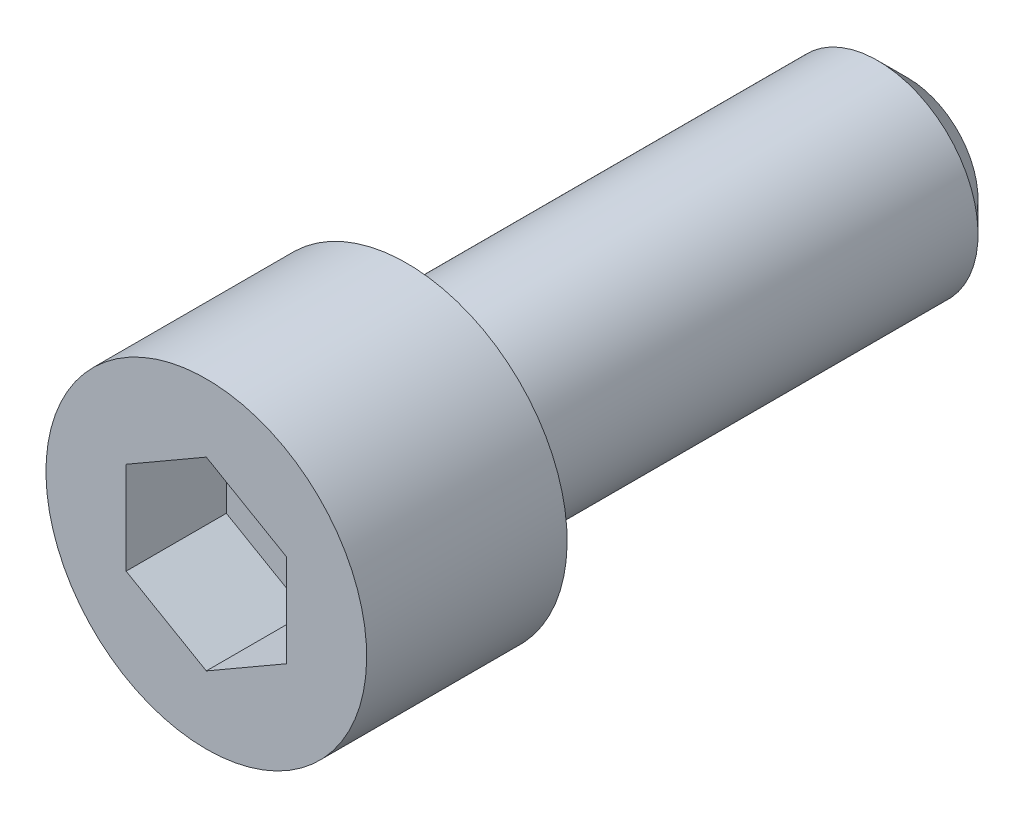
ISO-10303-21;
HEADER;
FILE_DESCRIPTION(('STEP AP214'),'2;1');
FILE_NAME('part.step','',(''),(''),'','','');
FILE_SCHEMA(('AUTOMOTIVE_DESIGN { 1 0 10303 214 1 1 1 1 }'));
ENDSEC;
DATA;
#1=APPLICATION_CONTEXT('core data for automotive mechanical design processes');
#2=APPLICATION_PROTOCOL_DEFINITION('international standard','automotive_design',2000,#1);
#3=PRODUCT_CONTEXT('',#1,'mechanical');
#4=PRODUCT('Part','Part','',(#3));
#5=PRODUCT_RELATED_PRODUCT_CATEGORY('part','',(#4));
#6=PRODUCT_DEFINITION_FORMATION('','',#4);
#7=PRODUCT_DEFINITION_CONTEXT('part definition',#1,'design');
#8=PRODUCT_DEFINITION('design','',#6,#7);
#9=PRODUCT_DEFINITION_SHAPE('','',#8);
#10=(LENGTH_UNIT() NAMED_UNIT(*) SI_UNIT(.MILLI.,.METRE.));
#11=(NAMED_UNIT(*) PLANE_ANGLE_UNIT() SI_UNIT($,.RADIAN.));
#12=(NAMED_UNIT(*) SI_UNIT($,.STERADIAN.) SOLID_ANGLE_UNIT());
#13=UNCERTAINTY_MEASURE_WITH_UNIT(LENGTH_MEASURE(1.E-05),#10,'distance_accuracy_value','');
#14=(GEOMETRIC_REPRESENTATION_CONTEXT(3) GLOBAL_UNCERTAINTY_ASSIGNED_CONTEXT((#13)) GLOBAL_UNIT_ASSIGNED_CONTEXT((#10,
#11,#12)) REPRESENTATION_CONTEXT('',''));
#15=CARTESIAN_POINT('',(0.,0.,0.));
#16=DIRECTION('',(0.,0.,1.));
#17=DIRECTION('',(1.,0.,0.));
#18=AXIS2_PLACEMENT_3D('',#15,#16,#17);
#19=CARTESIAN_POINT('',(0.,0.,10.));
#20=DIRECTION('',(0.,0.,-1.));
#21=DIRECTION('',(-0.866025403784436,0.5,0.));
#22=AXIS2_PLACEMENT_3D('',#19,#20,#21);
#23=PLANE('',#22);
#24=DIRECTION('',(-0.866025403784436,0.5,0.));
#25=VECTOR('',#24,1.);
#26=CARTESIAN_POINT('',(0.,4.61880215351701,10.));
#27=LINE('',#26,#25);
#28=CARTESIAN_POINT('',(4.,2.30940107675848,10.));
#29=VERTEX_POINT('',#28);
#30=CARTESIAN_POINT('',(0.,4.61880215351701,10.));
#31=VERTEX_POINT('',#30);
#32=EDGE_CURVE('E85',#29,#31,#27,.T.);
#33=ORIENTED_EDGE('',*,*,#32,.F.);
#34=DIRECTION('',(0.,1.,0.));
#35=VECTOR('',#34,1.);
#36=CARTESIAN_POINT('',(4.,2.30940107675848,10.));
#37=LINE('',#36,#35);
#38=CARTESIAN_POINT('',(4.,-2.30940107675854,10.));
#39=VERTEX_POINT('',#38);
#40=EDGE_CURVE('E31',#39,#29,#37,.T.);
#41=ORIENTED_EDGE('',*,*,#40,.F.);
#42=DIRECTION('',(0.86602540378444,0.499999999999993,0.));
#43=VECTOR('',#42,1.);
#44=CARTESIAN_POINT('',(0.,-4.61880215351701,10.));
#45=LINE('',#44,#43);
#46=CARTESIAN_POINT('',(0.,-4.61880215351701,10.));
#47=VERTEX_POINT('',#46);
#48=EDGE_CURVE('E100',#47,#39,#45,.T.);
#49=ORIENTED_EDGE('',*,*,#48,.F.);
#50=DIRECTION('',(0.866025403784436,-0.5,0.));
#51=VECTOR('',#50,1.);
#52=CARTESIAN_POINT('',(-4.,-2.30940107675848,10.));
#53=LINE('',#52,#51);
#54=CARTESIAN_POINT('',(-4.,-2.30940107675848,10.));
#55=VERTEX_POINT('',#54);
#56=EDGE_CURVE('E94',#55,#47,#53,.T.);
#57=ORIENTED_EDGE('',*,*,#56,.F.);
#58=DIRECTION('',(0.,-1.,0.));
#59=VECTOR('',#58,1.);
#60=CARTESIAN_POINT('',(-4.,-2.30940107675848,10.));
#61=LINE('',#60,#59);
#62=CARTESIAN_POINT('',(-4.,2.30940107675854,10.));
#63=VERTEX_POINT('',#62);
#64=EDGE_CURVE('E92',#63,#55,#61,.T.);
#65=ORIENTED_EDGE('',*,*,#64,.F.);
#66=DIRECTION('',(-0.86602540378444,-0.499999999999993,0.));
#67=VECTOR('',#66,1.);
#68=CARTESIAN_POINT('',(0.,4.61880215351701,10.));
#69=LINE('',#68,#67);
#70=EDGE_CURVE('E74',#31,#63,#69,.T.);
#71=ORIENTED_EDGE('',*,*,#70,.F.);
#72=EDGE_LOOP('',(#33,#41,#49,#57,#65,#71));
#73=FACE_BOUND('',#72,.T.);
#74=CARTESIAN_POINT('',(0.,0.,10.));
#75=DIRECTION('',(0.,0.,-1.));
#76=DIRECTION('',(-0.866025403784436,0.5,0.));
#77=AXIS2_PLACEMENT_3D('',#74,#75,#76);
#78=CIRCLE('',#77,8.);
#79=CARTESIAN_POINT('',(-6.92820323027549,4.,10.));
#80=VERTEX_POINT('',#79);
#81=EDGE_CURVE('E130',#80,#80,#78,.T.);
#82=ORIENTED_EDGE('',*,*,#81,.F.);
#83=EDGE_LOOP('',(#82));
#84=FACE_BOUND('',#83,.T.);
#85=ADVANCED_FACE('F16',(#73,#84),#23,.F.);
#86=CARTESIAN_POINT('',(0.,0.,0.));
#87=DIRECTION('',(0.,0.,-1.));
#88=DIRECTION('',(-0.866025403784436,0.5,0.));
#89=AXIS2_PLACEMENT_3D('',#86,#87,#88);
#90=CYLINDRICAL_SURFACE('',#89,8.);
#91=CARTESIAN_POINT('',(0.,0.,0.));
#92=DIRECTION('',(0.,0.,-1.));
#93=DIRECTION('',(-0.866025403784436,0.5,0.));
#94=AXIS2_PLACEMENT_3D('',#91,#92,#93);
#95=CIRCLE('',#94,8.);
#96=CARTESIAN_POINT('',(-6.92820323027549,4.,0.));
#97=VERTEX_POINT('',#96);
#98=EDGE_CURVE('E127',#97,#97,#95,.T.);
#99=ORIENTED_EDGE('',*,*,#98,.F.);
#100=EDGE_LOOP('',(#99));
#101=FACE_BOUND('',#100,.T.);
#102=ORIENTED_EDGE('',*,*,#81,.T.);
#103=EDGE_LOOP('',(#102));
#104=FACE_BOUND('',#103,.T.);
#105=ADVANCED_FACE('F149',(#101,#104),#90,.T.);
#106=CARTESIAN_POINT('',(4.,6.92820323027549,0.));
#107=DIRECTION('',(0.,0.,1.));
#108=DIRECTION('',(0.866025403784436,-0.5,0.));
#109=AXIS2_PLACEMENT_3D('',#106,#107,#108);
#110=PLANE('',#109);
#111=CARTESIAN_POINT('',(0.,0.,0.));
#112=DIRECTION('',(0.,0.,-1.));
#113=DIRECTION('',(-0.866025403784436,0.5,0.));
#114=AXIS2_PLACEMENT_3D('',#111,#112,#113);
#115=CIRCLE('',#114,5.);
#116=CARTESIAN_POINT('',(-4.33012701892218,2.5,0.));
#117=VERTEX_POINT('',#116);
#118=EDGE_CURVE('E118',#117,#117,#115,.T.);
#119=ORIENTED_EDGE('',*,*,#118,.F.);
#120=EDGE_LOOP('',(#119));
#121=FACE_BOUND('',#120,.T.);
#122=ORIENTED_EDGE('',*,*,#98,.T.);
#123=EDGE_LOOP('',(#122));
#124=FACE_BOUND('',#123,.T.);
#125=ADVANCED_FACE('F154',(#121,#124),#110,.F.);
#126=CARTESIAN_POINT('',(0.,0.,0.));
#127=DIRECTION('',(0.,0.,-1.));
#128=DIRECTION('',(-0.866025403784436,0.5,0.));
#129=AXIS2_PLACEMENT_3D('',#126,#127,#128);
#130=CYLINDRICAL_SURFACE('',#129,5.);
#131=CARTESIAN_POINT('',(0.,0.,-23.5));
#132=DIRECTION('',(0.,0.,1.));
#133=DIRECTION('',(0.866025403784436,-0.5,0.));
#134=AXIS2_PLACEMENT_3D('',#131,#132,#133);
#135=CIRCLE('',#134,5.);
#136=CARTESIAN_POINT('',(4.33012701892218,-2.5,-23.5));
#137=VERTEX_POINT('',#136);
#138=EDGE_CURVE('E11',#137,#137,#135,.T.);
#139=ORIENTED_EDGE('',*,*,#138,.T.);
#140=EDGE_LOOP('',(#139));
#141=FACE_BOUND('',#140,.T.);
#142=ORIENTED_EDGE('',*,*,#118,.T.);
#143=EDGE_LOOP('',(#142));
#144=FACE_BOUND('',#143,.T.);
#145=ADVANCED_FACE('F160',(#141,#144),#130,.T.);
#146=CARTESIAN_POINT('',(2.5,4.33012701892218,-25.));
#147=DIRECTION('',(0.,0.,1.));
#148=DIRECTION('',(0.866025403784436,-0.5,0.));
#149=AXIS2_PLACEMENT_3D('',#146,#147,#148);
#150=PLANE('',#149);
#151=CARTESIAN_POINT('',(0.,0.,-25.));
#152=DIRECTION('',(0.,0.,1.));
#153=DIRECTION('',(0.866025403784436,-0.5,0.));
#154=AXIS2_PLACEMENT_3D('',#151,#152,#153);
#155=CIRCLE('',#154,3.5);
#156=CARTESIAN_POINT('',(3.03108891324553,-1.75,-25.));
#157=VERTEX_POINT('',#156);
#158=EDGE_CURVE('E24',#157,#157,#155,.F.);
#159=ORIENTED_EDGE('',*,*,#158,.T.);
#160=EDGE_LOOP('',(#159));
#161=FACE_BOUND('',#160,.T.);
#162=ADVANCED_FACE('F135',(#161),#150,.F.);
#163=CARTESIAN_POINT('',(4.,2.30940107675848,5.));
#164=DIRECTION('',(1.,0.,0.));
#165=DIRECTION('',(0.,1.,0.));
#166=AXIS2_PLACEMENT_3D('',#163,#164,#165);
#167=PLANE('',#166);
#168=ORIENTED_EDGE('',*,*,#40,.T.);
#169=DIRECTION('',(0.,0.,1.));
#170=VECTOR('',#169,1.);
#171=CARTESIAN_POINT('',(4.,2.30940107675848,5.));
#172=LINE('',#171,#170);
#173=CARTESIAN_POINT('',(4.,2.30940107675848,5.));
#174=VERTEX_POINT('',#173);
#175=EDGE_CURVE('E82',#174,#29,#172,.T.);
#176=ORIENTED_EDGE('',*,*,#175,.F.);
#177=DIRECTION('',(0.,1.,0.));
#178=VECTOR('',#177,1.);
#179=CARTESIAN_POINT('',(4.,2.30940107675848,5.));
#180=LINE('',#179,#178);
#181=CARTESIAN_POINT('',(4.,-2.30940107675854,5.));
#182=VERTEX_POINT('',#181);
#183=EDGE_CURVE('E102',#182,#174,#180,.T.);
#184=ORIENTED_EDGE('',*,*,#183,.F.);
#185=DIRECTION('',(0.,0.,1.));
#186=VECTOR('',#185,1.);
#187=CARTESIAN_POINT('',(4.,-2.30940107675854,5.));
#188=LINE('',#187,#186);
#189=EDGE_CURVE('E38',#182,#39,#188,.T.);
#190=ORIENTED_EDGE('',*,*,#189,.T.);
#191=EDGE_LOOP('',(#168,#176,#184,#190));
#192=FACE_BOUND('',#191,.T.);
#193=ADVANCED_FACE('F167',(#192),#167,.F.);
#194=CARTESIAN_POINT('',(0.,-4.61880215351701,5.));
#195=DIRECTION('',(0.499999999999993,-0.86602540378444,0.));
#196=DIRECTION('',(0.86602540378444,0.499999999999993,0.));
#197=AXIS2_PLACEMENT_3D('',#194,#195,#196);
#198=PLANE('',#197);
#199=ORIENTED_EDGE('',*,*,#48,.T.);
#200=ORIENTED_EDGE('',*,*,#189,.F.);
#201=DIRECTION('',(0.86602540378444,0.499999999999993,0.));
#202=VECTOR('',#201,1.);
#203=CARTESIAN_POINT('',(0.,-4.61880215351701,5.));
#204=LINE('',#203,#202);
#205=CARTESIAN_POINT('',(0.,-4.61880215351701,5.));
#206=VERTEX_POINT('',#205);
#207=EDGE_CURVE('E114',#206,#182,#204,.T.);
#208=ORIENTED_EDGE('',*,*,#207,.F.);
#209=DIRECTION('',(0.,0.,1.));
#210=VECTOR('',#209,1.);
#211=CARTESIAN_POINT('',(0.,-4.61880215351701,5.));
#212=LINE('',#211,#210);
#213=EDGE_CURVE('E119',#206,#47,#212,.T.);
#214=ORIENTED_EDGE('',*,*,#213,.T.);
#215=EDGE_LOOP('',(#199,#200,#208,#214));
#216=FACE_BOUND('',#215,.T.);
#217=ADVANCED_FACE('F170',(#216),#198,.F.);
#218=CARTESIAN_POINT('',(-4.,-2.30940107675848,5.));
#219=DIRECTION('',(-0.5,-0.866025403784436,0.));
#220=DIRECTION('',(0.,0.,-1.));
#221=AXIS2_PLACEMENT_3D('',#218,#219,#220);
#222=PLANE('',#221);
#223=ORIENTED_EDGE('',*,*,#56,.T.);
#224=ORIENTED_EDGE('',*,*,#213,.F.);
#225=DIRECTION('',(0.866025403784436,-0.5,0.));
#226=VECTOR('',#225,1.);
#227=CARTESIAN_POINT('',(-4.,-2.30940107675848,5.));
#228=LINE('',#227,#226);
#229=CARTESIAN_POINT('',(-4.,-2.30940107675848,5.));
#230=VERTEX_POINT('',#229);
#231=EDGE_CURVE('E111',#230,#206,#228,.T.);
#232=ORIENTED_EDGE('',*,*,#231,.F.);
#233=DIRECTION('',(0.,0.,1.));
#234=VECTOR('',#233,1.);
#235=CARTESIAN_POINT('',(-4.,-2.30940107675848,5.));
#236=LINE('',#235,#234);
#237=EDGE_CURVE('E121',#230,#55,#236,.T.);
#238=ORIENTED_EDGE('',*,*,#237,.T.);
#239=EDGE_LOOP('',(#223,#224,#232,#238));
#240=FACE_BOUND('',#239,.T.);
#241=ADVANCED_FACE('F178',(#240),#222,.F.);
#242=CARTESIAN_POINT('',(-4.,-2.30940107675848,5.));
#243=DIRECTION('',(-1.,0.,0.));
#244=DIRECTION('',(0.,-1.,0.));
#245=AXIS2_PLACEMENT_3D('',#242,#243,#244);
#246=PLANE('',#245);
#247=ORIENTED_EDGE('',*,*,#64,.T.);
#248=ORIENTED_EDGE('',*,*,#237,.F.);
#249=DIRECTION('',(0.,-1.,0.));
#250=VECTOR('',#249,1.);
#251=CARTESIAN_POINT('',(-4.,-2.30940107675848,5.));
#252=LINE('',#251,#250);
#253=CARTESIAN_POINT('',(-4.,2.30940107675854,5.));
#254=VERTEX_POINT('',#253);
#255=EDGE_CURVE('E108',#254,#230,#252,.T.);
#256=ORIENTED_EDGE('',*,*,#255,.F.);
#257=DIRECTION('',(0.,0.,1.));
#258=VECTOR('',#257,1.);
#259=CARTESIAN_POINT('',(-4.,2.30940107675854,5.));
#260=LINE('',#259,#258);
#261=EDGE_CURVE('E81',#254,#63,#260,.T.);
#262=ORIENTED_EDGE('',*,*,#261,.T.);
#263=EDGE_LOOP('',(#247,#248,#256,#262));
#264=FACE_BOUND('',#263,.T.);
#265=ADVANCED_FACE('F175',(#264),#246,.F.);
#266=CARTESIAN_POINT('',(0.,4.61880215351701,5.));
#267=DIRECTION('',(-0.499999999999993,0.86602540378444,0.));
#268=DIRECTION('',(-0.86602540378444,-0.499999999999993,0.));
#269=AXIS2_PLACEMENT_3D('',#266,#267,#268);
#270=PLANE('',#269);
#271=ORIENTED_EDGE('',*,*,#70,.T.);
#272=ORIENTED_EDGE('',*,*,#261,.F.);
#273=DIRECTION('',(-0.86602540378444,-0.499999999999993,0.));
#274=VECTOR('',#273,1.);
#275=CARTESIAN_POINT('',(0.,4.61880215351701,5.));
#276=LINE('',#275,#274);
#277=CARTESIAN_POINT('',(0.,4.61880215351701,5.));
#278=VERTEX_POINT('',#277);
#279=EDGE_CURVE('E77',#278,#254,#276,.T.);
#280=ORIENTED_EDGE('',*,*,#279,.F.);
#281=DIRECTION('',(0.,0.,1.));
#282=VECTOR('',#281,1.);
#283=CARTESIAN_POINT('',(0.,4.61880215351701,5.));
#284=LINE('',#283,#282);
#285=EDGE_CURVE('E70',#278,#31,#284,.T.);
#286=ORIENTED_EDGE('',*,*,#285,.T.);
#287=EDGE_LOOP('',(#271,#272,#280,#286));
#288=FACE_BOUND('',#287,.T.);
#289=ADVANCED_FACE('F72',(#288),#270,.F.);
#290=CARTESIAN_POINT('',(0.,4.61880215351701,5.));
#291=DIRECTION('',(0.5,0.866025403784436,0.));
#292=DIRECTION('',(0.,0.,1.));
#293=AXIS2_PLACEMENT_3D('',#290,#291,#292);
#294=PLANE('',#293);
#295=ORIENTED_EDGE('',*,*,#32,.T.);
#296=ORIENTED_EDGE('',*,*,#285,.F.);
#297=DIRECTION('',(-0.866025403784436,0.5,0.));
#298=VECTOR('',#297,1.);
#299=CARTESIAN_POINT('',(0.,4.61880215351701,5.));
#300=LINE('',#299,#298);
#301=EDGE_CURVE('E105',#174,#278,#300,.T.);
#302=ORIENTED_EDGE('',*,*,#301,.F.);
#303=ORIENTED_EDGE('',*,*,#175,.T.);
#304=EDGE_LOOP('',(#295,#296,#302,#303));
#305=FACE_BOUND('',#304,.T.);
#306=ADVANCED_FACE('F86',(#305),#294,.F.);
#307=CARTESIAN_POINT('',(4.,6.92820323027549,5.));
#308=DIRECTION('',(0.,0.,-1.));
#309=DIRECTION('',(-0.866025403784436,0.5,0.));
#310=AXIS2_PLACEMENT_3D('',#307,#308,#309);
#311=PLANE('',#310);
#312=ORIENTED_EDGE('',*,*,#183,.T.);
#313=ORIENTED_EDGE('',*,*,#301,.T.);
#314=ORIENTED_EDGE('',*,*,#279,.T.);
#315=ORIENTED_EDGE('',*,*,#255,.T.);
#316=ORIENTED_EDGE('',*,*,#231,.T.);
#317=ORIENTED_EDGE('',*,*,#207,.T.);
#318=EDGE_LOOP('',(#312,#313,#314,#315,#316,#317));
#319=FACE_BOUND('',#318,.T.);
#320=ADVANCED_FACE('F138',(#319),#311,.F.);
#321=CARTESIAN_POINT('',(0.,0.,-25.));
#322=DIRECTION('',(0.,0.,1.));
#323=DIRECTION('',(0.866025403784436,-0.5,0.));
#324=AXIS2_PLACEMENT_3D('',#321,#322,#323);
#325=CONICAL_SURFACE('',#324,3.5,0.785398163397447);
#326=ORIENTED_EDGE('',*,*,#138,.F.);
#327=EDGE_LOOP('',(#326));
#328=FACE_BOUND('',#327,.T.);
#329=ORIENTED_EDGE('',*,*,#158,.F.);
#330=EDGE_LOOP('',(#329));
#331=FACE_BOUND('',#330,.T.);
#332=ADVANCED_FACE('F18',(#328,#331),#325,.T.);
#333=CLOSED_SHELL('',(#85,#105,#125,#145,#162,#193,#217,#241,#265,#289,#306,#320,#332));
#334=MANIFOLD_SOLID_BREP('B1',#333);
#335=ADVANCED_BREP_SHAPE_REPRESENTATION('',(#18,#334),#14);
#336=SHAPE_DEFINITION_REPRESENTATION(#9,#335);
ENDSEC;
END-ISO-10303-21;
